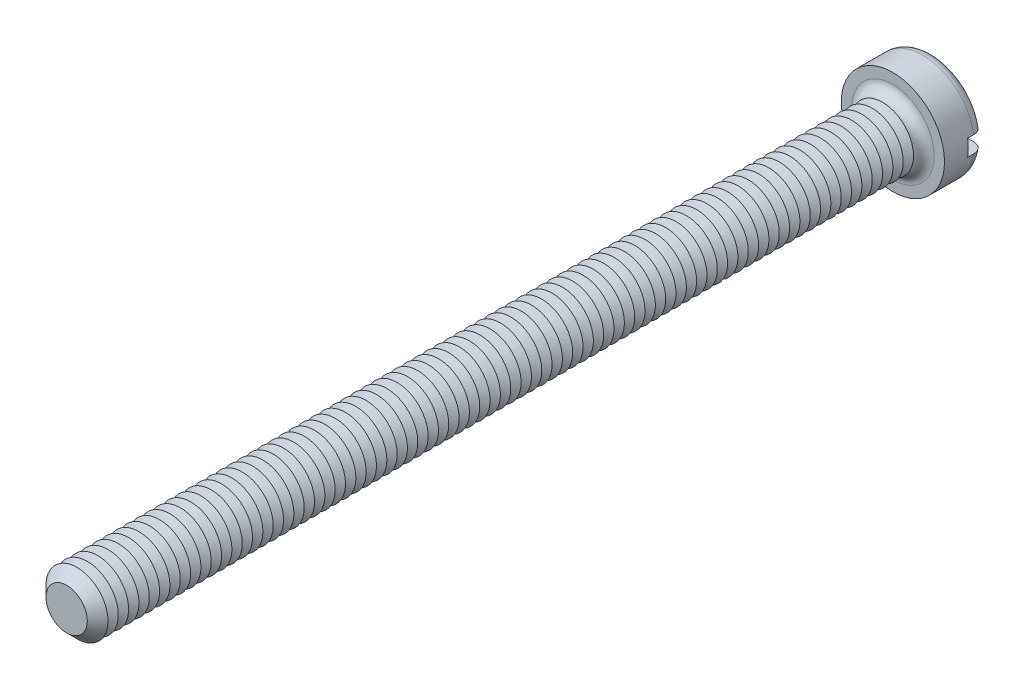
from build123d import *

# Parameters (mm, degrees)
SKETCH3_R           = 5
BOSS_EXTRUDE2_DEPTH = 3.9
SKETCH4_R           = 3
BOSS_EXTRUDE3_DEPTH = 80
FILLET1_R           = 1
CHAMFER1_SIZE       = 1
LPATTERN1_COUNT     = 78
LPATTERN1_PITCH     = 1
SKETCH8_W           = 10
SKETCH8_H           = 1.6
CUT_EXTRUDE1_DEPTH  = 1.6


with BuildPart() as part:
    # Sketch3 → Boss-Extrude2 (new body)
    with BuildSketch(Plane.XY):
        Circle(SKETCH3_R)
    extrude(amount=-BOSS_EXTRUDE2_DEPTH)

    # Sketch4 → Boss-Extrude3 (add)
    with BuildSketch(Plane.XY):
        Circle(SKETCH4_R)
    extrude(amount=BOSS_EXTRUDE3_DEPTH)

    # Fillet1
    fillet1_edges = [part.edges().sort_by_distance(p)[0] for p in [
        (-5, 0, -3.9),
        (-3, 0, 0),
    ]]
    fillet(fillet1_edges, radius=FILLET1_R)

    # Chamfer1
    chamfer1_edges = [part.edges().sort_by_distance(p)[0] for p in [
        (-3, 0, 80),
    ]]
    chamfer(chamfer1_edges, length=CHAMFER1_SIZE)

    # Sketch6 → Cut-Revolve1 (revolve, cut)
    with BuildSketch(Plane(origin=(0, 0, 0), x_dir=(0, 0, -1), z_dir=(1, 0, 0)), mode=Mode.PRIVATE) as cut_revolve1_sk:
        Polygon((-1, 3), (-1.5, 2.133974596), (-2, 3), align=None)
    cut_revolve1 = revolve(cut_revolve1_sk.sketch.rotate(Axis((0, 0, -1.694361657), (0, 0, 1)), 90), axis=Axis((0, 0, -1.694361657), (0, 0, 1)), mode=Mode.SUBTRACT)

    # LPattern1: Cut-Revolve1 ×78
    with Locations(*[(0, 0, i * LPATTERN1_PITCH) for i in range(1, LPATTERN1_COUNT)]):
        add(cut_revolve1, mode=Mode.SUBTRACT)

    # Sketch8 → Cut-Extrude1 (cut)
    with BuildSketch(Plane(origin=(0, 0, -3.9), x_dir=(-1, 0, 0), z_dir=(0, 0, -1))):
        Rectangle(SKETCH8_W, SKETCH8_H)
    extrude(amount=-CUT_EXTRUDE1_DEPTH, mode=Mode.SUBTRACT)


solid = part.part
